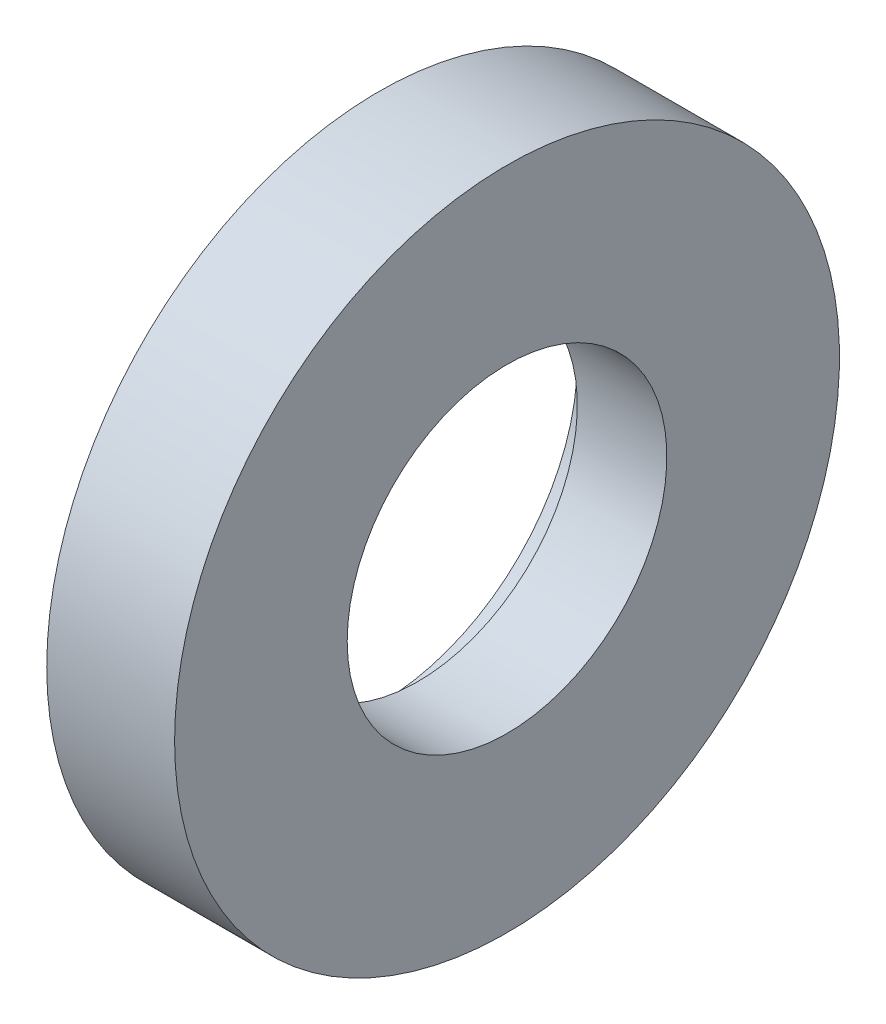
from build123d import *


with BuildPart() as part:
    # Esquisse1 → R_volution1 (revolve)
    with BuildSketch(Plane.XY, mode=Mode.PRIVATE) as r_volution1_sk:
        Polygon((0, 15.5), (0, 26), (10, 26), (10, 12.5), (3, 12.5), (3, 15.5), align=None)
    revolve(r_volution1_sk.sketch.rotate(Axis((-24.149081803, 0, 0), (1, 0, 0)), 90), axis=Axis((-24.149081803, 0, 0), (1, 0, 0)))


solid = part.part
